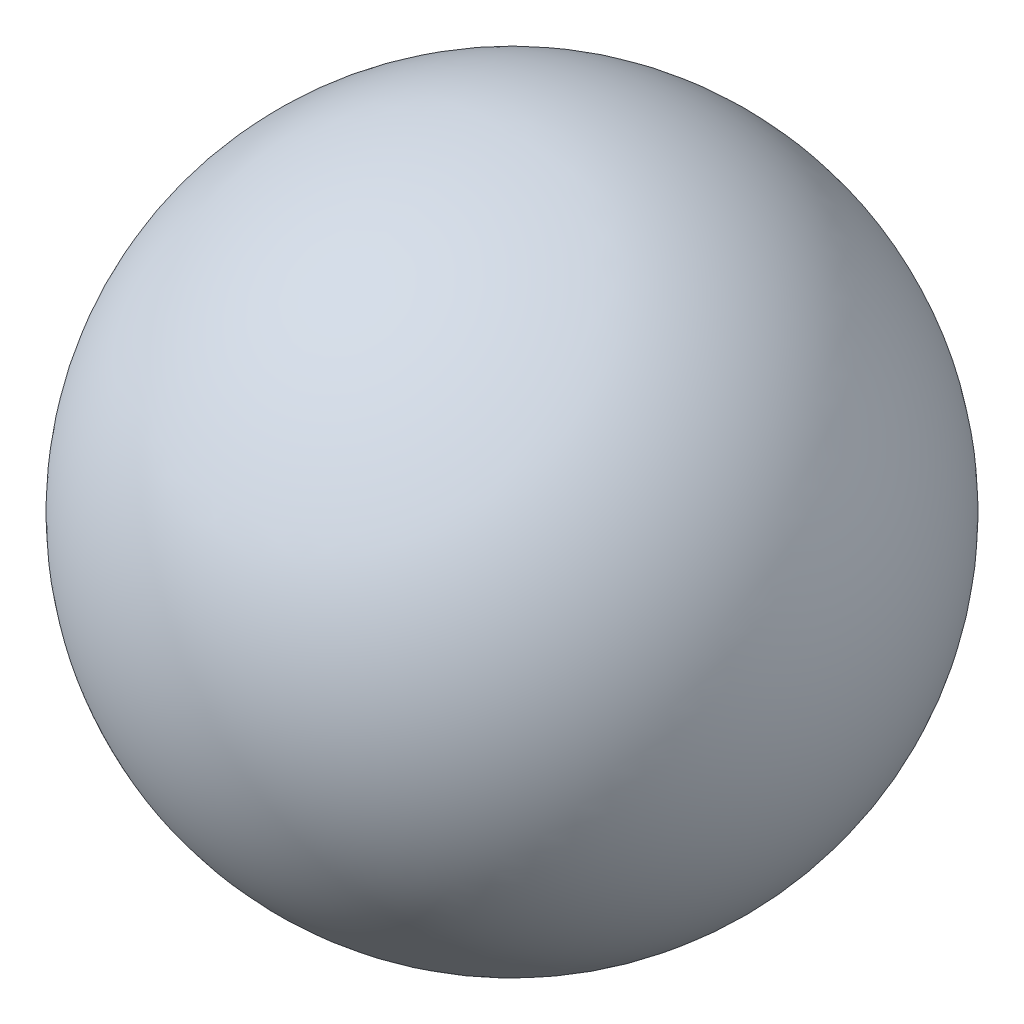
ISO-10303-21;
HEADER;
FILE_DESCRIPTION(('STEP AP214'),'2;1');
FILE_NAME('part.step','',(''),(''),'','','');
FILE_SCHEMA(('AUTOMOTIVE_DESIGN { 1 0 10303 214 1 1 1 1 }'));
ENDSEC;
DATA;
#1=APPLICATION_CONTEXT('core data for automotive mechanical design processes');
#2=APPLICATION_PROTOCOL_DEFINITION('international standard','automotive_design',2000,#1);
#3=PRODUCT_CONTEXT('',#1,'mechanical');
#4=PRODUCT('Part','Part','',(#3));
#5=PRODUCT_RELATED_PRODUCT_CATEGORY('part','',(#4));
#6=PRODUCT_DEFINITION_FORMATION('','',#4);
#7=PRODUCT_DEFINITION_CONTEXT('part definition',#1,'design');
#8=PRODUCT_DEFINITION('design','',#6,#7);
#9=PRODUCT_DEFINITION_SHAPE('','',#8);
#10=(LENGTH_UNIT() NAMED_UNIT(*) SI_UNIT(.MILLI.,.METRE.));
#11=(NAMED_UNIT(*) PLANE_ANGLE_UNIT() SI_UNIT($,.RADIAN.));
#12=(NAMED_UNIT(*) SI_UNIT($,.STERADIAN.) SOLID_ANGLE_UNIT());
#13=UNCERTAINTY_MEASURE_WITH_UNIT(LENGTH_MEASURE(1.E-05),#10,'distance_accuracy_value','');
#14=(GEOMETRIC_REPRESENTATION_CONTEXT(3) GLOBAL_UNCERTAINTY_ASSIGNED_CONTEXT((#13)) GLOBAL_UNIT_ASSIGNED_CONTEXT((#10,
#11,#12)) REPRESENTATION_CONTEXT('',''));
#15=CARTESIAN_POINT('',(0.,0.,0.));
#16=DIRECTION('',(0.,0.,1.));
#17=DIRECTION('',(1.,0.,0.));
#18=AXIS2_PLACEMENT_3D('',#15,#16,#17);
#19=CARTESIAN_POINT('',(0.,0.,0.));
#20=DIRECTION('',(0.,0.,-1.));
#21=DIRECTION('',(-1.,0.,0.));
#22=AXIS2_PLACEMENT_3D('',#19,#20,#21);
#23=CYLINDRICAL_SURFACE('',#22,2.5);
#24=CARTESIAN_POINT('',(0.,0.,0.45));
#25=DIRECTION('',(0.,0.,1.));
#26=DIRECTION('',(1.,0.,0.));
#27=AXIS2_PLACEMENT_3D('',#24,#25,#26);
#28=CIRCLE('',#27,2.5);
#29=CARTESIAN_POINT('',(2.5,0.,0.45));
#30=VERTEX_POINT('',#29);
#31=EDGE_CURVE('E19',#30,#30,#28,.F.);
#32=ORIENTED_EDGE('',*,*,#31,.T.);
#33=EDGE_LOOP('',(#32));
#34=FACE_BOUND('',#33,.T.);
#35=CARTESIAN_POINT('',(0.,0.,10.));
#36=DIRECTION('',(0.,0.,-1.));
#37=DIRECTION('',(-1.,0.,0.));
#38=AXIS2_PLACEMENT_3D('',#35,#36,#37);
#39=CIRCLE('',#38,2.5);
#40=CARTESIAN_POINT('',(-2.5,0.,10.));
#41=VERTEX_POINT('',#40);
#42=EDGE_CURVE('E27',#41,#41,#39,.T.);
#43=ORIENTED_EDGE('',*,*,#42,.F.);
#44=EDGE_LOOP('',(#43));
#45=FACE_BOUND('',#44,.T.);
#46=ADVANCED_FACE('F12',(#34,#45),#23,.F.);
#47=CARTESIAN_POINT('',(2.1,0.,10.));
#48=DIRECTION('',(0.,0.,1.));
#49=DIRECTION('',(1.,0.,0.));
#50=AXIS2_PLACEMENT_3D('',#47,#48,#49);
#51=PLANE('',#50);
#52=ORIENTED_EDGE('',*,*,#42,.T.);
#53=EDGE_LOOP('',(#52));
#54=FACE_BOUND('',#53,.T.);
#55=ADVANCED_FACE('F33',(#54),#51,.F.);
#56=CARTESIAN_POINT('',(0.,0.,8.));
#57=DIRECTION('',(0.,0.,1.));
#58=DIRECTION('',(0.,1.,0.));
#59=AXIS2_PLACEMENT_3D('',#56,#57,#58);
#60=SPHERICAL_SURFACE('',#59,10.);
#61=CARTESIAN_POINT('',(0.,0.,0.));
#62=DIRECTION('',(0.,0.,1.));
#63=DIRECTION('',(1.,0.,0.));
#64=AXIS2_PLACEMENT_3D('',#61,#62,#63);
#65=CIRCLE('',#64,6.);
#66=CARTESIAN_POINT('',(6.,0.,0.));
#67=VERTEX_POINT('',#66);
#68=EDGE_CURVE('E23',#67,#67,#65,.T.);
#69=ORIENTED_EDGE('',*,*,#68,.T.);
#70=EDGE_LOOP('',(#69));
#71=FACE_BOUND('',#70,.T.);
#72=ADVANCED_FACE('F42',(#71),#60,.T.);
#73=CARTESIAN_POINT('',(0.,0.,0.));
#74=DIRECTION('',(0.,0.,1.));
#75=DIRECTION('',(1.,0.,0.));
#76=AXIS2_PLACEMENT_3D('',#73,#74,#75);
#77=PLANE('',#76);
#78=CARTESIAN_POINT('',(0.,0.,0.));
#79=DIRECTION('',(0.,0.,1.));
#80=DIRECTION('',(1.,0.,0.));
#81=AXIS2_PLACEMENT_3D('',#78,#79,#80);
#82=CIRCLE('',#81,2.95);
#83=CARTESIAN_POINT('',(2.95,0.,0.));
#84=VERTEX_POINT('',#83);
#85=EDGE_CURVE('E8',#84,#84,#82,.T.);
#86=ORIENTED_EDGE('',*,*,#85,.T.);
#87=EDGE_LOOP('',(#86));
#88=FACE_BOUND('',#87,.T.);
#89=ORIENTED_EDGE('',*,*,#68,.F.);
#90=EDGE_LOOP('',(#89));
#91=FACE_BOUND('',#90,.T.);
#92=ADVANCED_FACE('F46',(#88,#91),#77,.F.);
#93=CARTESIAN_POINT('',(0.,0.,0.45));
#94=DIRECTION('',(0.,0.,-1.));
#95=DIRECTION('',(-1.,0.,0.));
#96=AXIS2_PLACEMENT_3D('',#93,#94,#95);
#97=CONICAL_SURFACE('',#96,2.5,0.78539816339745);
#98=ORIENTED_EDGE('',*,*,#85,.F.);
#99=EDGE_LOOP('',(#98));
#100=FACE_BOUND('',#99,.T.);
#101=ORIENTED_EDGE('',*,*,#31,.F.);
#102=EDGE_LOOP('',(#101));
#103=FACE_BOUND('',#102,.T.);
#104=ADVANCED_FACE('F14',(#100,#103),#97,.F.);
#105=CLOSED_SHELL('',(#46,#55,#72,#92,#104));
#106=MANIFOLD_SOLID_BREP('B1',#105);
#107=ADVANCED_BREP_SHAPE_REPRESENTATION('',(#18,#106),#14);
#108=SHAPE_DEFINITION_REPRESENTATION(#9,#107);
ENDSEC;
END-ISO-10303-21;
